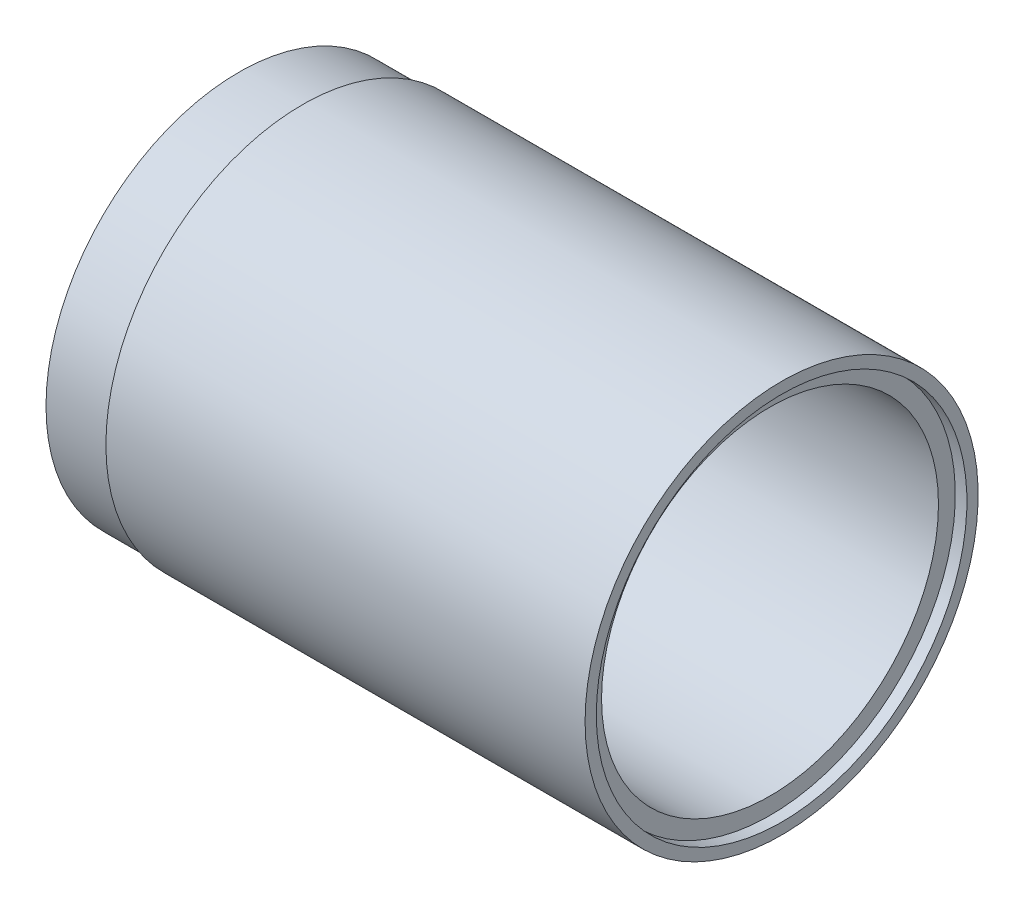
from build123d import *


with BuildPart() as part:
    # Esquisse1 → R_volution1 (revolve)
    with BuildSketch(Plane.XY, mode=Mode.PRIVATE) as r_volution1_sk:
        Polygon((0, 51.5), (17, 51.5), (17, 52.5), (145, 52.5), (145, 49.5), (141.9, 49.5), (141.9, 45), (0, 45), align=None)
    revolve(r_volution1_sk.sketch.rotate(Axis((0, 0, 0), (1, 0, 0)), 90), axis=Axis((0, 0, 0), (1, 0, 0)))


solid = part.part
